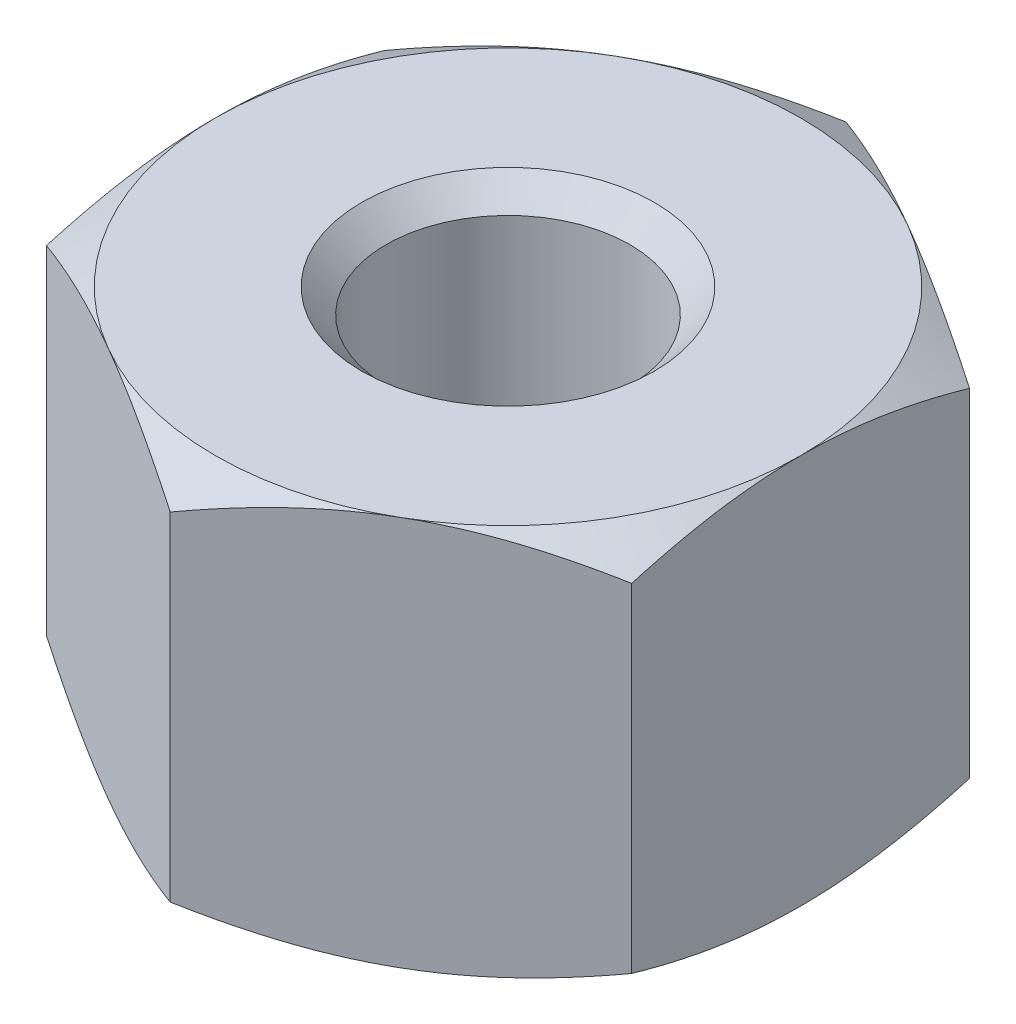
from build123d import *

# Parameters (mm, degrees)
BOSS_EXTRUDE1_DEPTH     = 2
SKETCH2_OUTSIDE_W       = 18.314
SKETCH2_OUTSIDE_H       = 19.242
SKETCH2_OUTSIDE_R       = 3
CUT_EXTRUDE1_DEPTH      = 2.4
CUT_EXTRUDE1_DRAFT      = -60
MIRROR1_COPY_1_SKETCH_W = 18.314
MIRROR1_COPY_1_SKETCH_H = 19.242
MIRROR1_COPY_1_SKETCH_R = 3
MIRROR1_COPY_1_DEPTH    = 2.4
MIRROR1_COPY_1_DRAFT    = -60
TAPPED_HOLE2_D          = 2.5
CHAMFER1_SIZE           = 0.25


with BuildPart() as part:
    # Sketch1 → Boss-Extrude1 (new, symmetric)
    with BuildSketch(Plane(origin=(0, 0, 0), x_dir=(1, 0, 0), z_dir=(0, 1, 0))):
        Polygon((3, -1.732050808), (3, 1.732050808), (0, 3.464101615), (-3, 1.732050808), (-3, -1.732050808), (0, -3.464101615), align=None)
    extrude(amount=BOSS_EXTRUDE1_DEPTH, both=True)


with BuildPart() as cut_extrude1_tool:
    # Sketch2 outside → Cut-Extrude1 (with draft: the straight prism first)
    with BuildSketch(Plane(origin=(0, 2, 0), x_dir=(1, 0, 0), z_dir=(0, 1, 0))):
        Rectangle(SKETCH2_OUTSIDE_W, SKETCH2_OUTSIDE_H)
        Circle(SKETCH2_OUTSIDE_R, mode=Mode.SUBTRACT)
    extrude(amount=-CUT_EXTRUDE1_DEPTH)
    # Cut-Extrude1: the draft: its side faces are tilted about the plane it starts from
    cut_extrude1_sides = [cut_extrude1_tool.faces().sort_by_distance(p)[0] for p in [
        (0, 0.8, 9.621),
        (9.157, 0.8, 0),
        (0, 0.8, -9.621),
        (-9.157, 0.8, 0),
        (-3, 0.8, 0),
    ]]
    draft(cut_extrude1_sides, Plane(origin=(0, 2, 0), x_dir=(1, 0, 0), z_dir=(0, 1, 0)), CUT_EXTRUDE1_DRAFT)


with BuildPart() as part_1:
    add(part.part)

    # Cut-Extrude1: cut by cut_extrude1_tool
    add(cut_extrude1_tool.part, mode=Mode.SUBTRACT)


with BuildPart() as mirror1_copy_1_tool:
    # Mirror1 copy 1 sketch → Mirror1 copy 1 (with draft: the straight prism first)
    with BuildSketch(Plane.XZ.offset(2)):
        Rectangle(MIRROR1_COPY_1_SKETCH_W, MIRROR1_COPY_1_SKETCH_H)
        Circle(MIRROR1_COPY_1_SKETCH_R, mode=Mode.SUBTRACT)
    extrude(amount=-MIRROR1_COPY_1_DEPTH)
    # Mirror1 copy 1: the draft: its side faces are tilted about the plane it starts from
    mirror1_copy_1_sides = [mirror1_copy_1_tool.faces().sort_by_distance(p)[0] for p in [
        (0, -0.8, 9.621),
        (9.157, -0.8, 0),
        (0, -0.8, -9.621),
        (-9.157, -0.8, 0),
        (-3, -0.8, 0),
    ]]
    draft(mirror1_copy_1_sides, Plane.XZ.offset(2), MIRROR1_COPY_1_DRAFT)


with BuildPart() as part_2:
    add(part_1.part)

    # Mirror1 copy 1: cut by mirror1_copy_1_tool
    add(mirror1_copy_1_tool.part, mode=Mode.SUBTRACT)

    # Tapped Hole2 (through all)
    with Locations(Plane(origin=(0, -2, 0), x_dir=(-1, 0, 0), z_dir=(0, -1, 0))):
        with Locations((0, 0)):
            Hole(TAPPED_HOLE2_D / 2)

    # Chamfer1
    chamfer1_edges = [part_2.edges().sort_by_distance(p)[0] for p in [
        (-1.25, -2, 0),
        (-1.25, 2, 0),
    ]]
    chamfer(chamfer1_edges, length=CHAMFER1_SIZE)


solid = part_2.part
